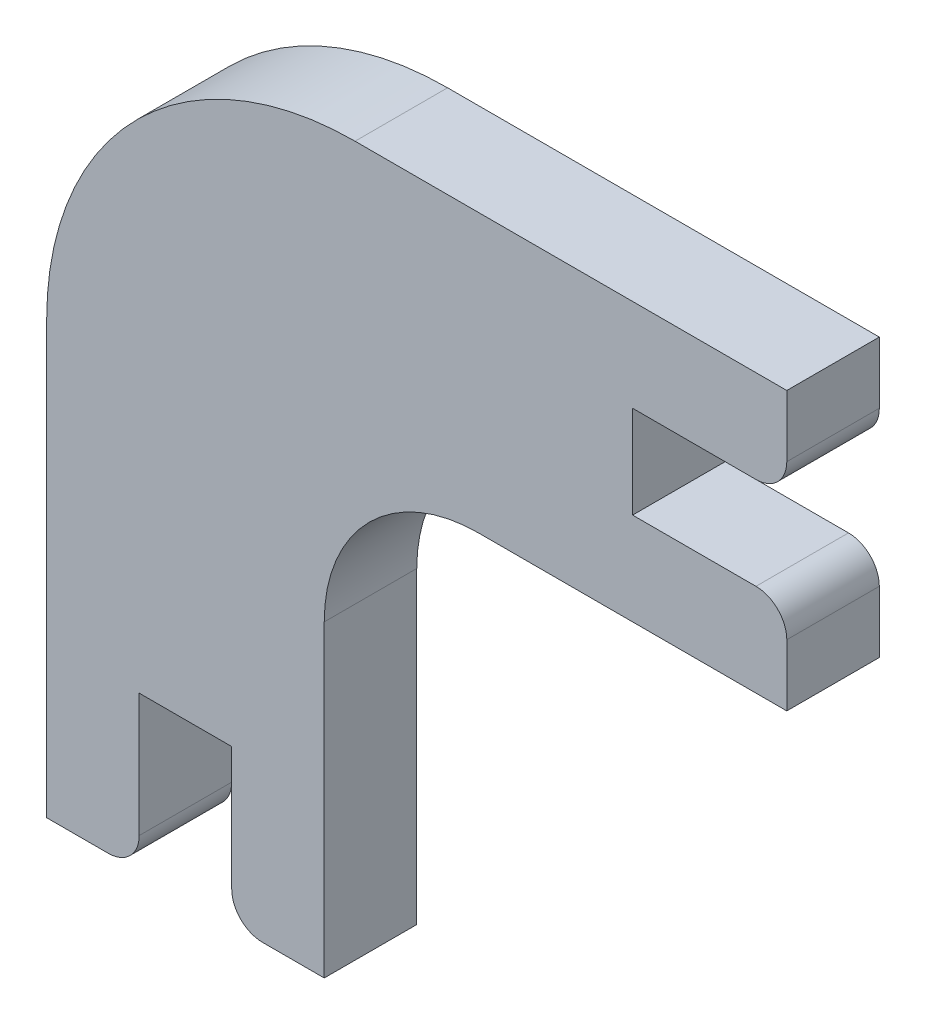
ISO-10303-21;
HEADER;
FILE_DESCRIPTION(('STEP AP214'),'2;1');
FILE_NAME('part.step','',(''),(''),'','','');
FILE_SCHEMA(('AUTOMOTIVE_DESIGN { 1 0 10303 214 1 1 1 1 }'));
ENDSEC;
DATA;
#1=APPLICATION_CONTEXT('core data for automotive mechanical design processes');
#2=APPLICATION_PROTOCOL_DEFINITION('international standard','automotive_design',2000,#1);
#3=PRODUCT_CONTEXT('',#1,'mechanical');
#4=PRODUCT('Part','Part','',(#3));
#5=PRODUCT_RELATED_PRODUCT_CATEGORY('part','',(#4));
#6=PRODUCT_DEFINITION_FORMATION('','',#4);
#7=PRODUCT_DEFINITION_CONTEXT('part definition',#1,'design');
#8=PRODUCT_DEFINITION('design','',#6,#7);
#9=PRODUCT_DEFINITION_SHAPE('','',#8);
#10=(LENGTH_UNIT() NAMED_UNIT(*) SI_UNIT(.MILLI.,.METRE.));
#11=(NAMED_UNIT(*) PLANE_ANGLE_UNIT() SI_UNIT($,.RADIAN.));
#12=(NAMED_UNIT(*) SI_UNIT($,.STERADIAN.) SOLID_ANGLE_UNIT());
#13=UNCERTAINTY_MEASURE_WITH_UNIT(LENGTH_MEASURE(1.E-05),#10,'distance_accuracy_value','');
#14=(GEOMETRIC_REPRESENTATION_CONTEXT(3) GLOBAL_UNCERTAINTY_ASSIGNED_CONTEXT((#13)) GLOBAL_UNIT_ASSIGNED_CONTEXT((#10,
#11,#12)) REPRESENTATION_CONTEXT('',''));
#15=CARTESIAN_POINT('',(0.,0.,0.));
#16=DIRECTION('',(0.,0.,1.));
#17=DIRECTION('',(1.,0.,0.));
#18=AXIS2_PLACEMENT_3D('',#15,#16,#17);
#19=CARTESIAN_POINT('',(0.,12.,3.));
#20=DIRECTION('',(-1.,0.,0.));
#21=DIRECTION('',(0.,0.,1.));
#22=AXIS2_PLACEMENT_3D('',#19,#20,#21);
#23=PLANE('',#22);
#24=DIRECTION('',(0.,1.,0.));
#25=VECTOR('',#24,1.);
#26=CARTESIAN_POINT('',(0.,12.,3.));
#27=LINE('',#26,#25);
#28=CARTESIAN_POINT('',(0.,14.,3.));
#29=VERTEX_POINT('',#28);
#30=CARTESIAN_POINT('',(0.,18.,3.));
#31=VERTEX_POINT('',#30);
#32=EDGE_CURVE('E167',#29,#31,#27,.T.);
#33=ORIENTED_EDGE('',*,*,#32,.F.);
#34=DIRECTION('',(0.,0.,-1.));
#35=VECTOR('',#34,1.);
#36=CARTESIAN_POINT('',(0.,14.,-3.));
#37=LINE('',#36,#35);
#38=CARTESIAN_POINT('',(0.,14.,-3.));
#39=VERTEX_POINT('',#38);
#40=EDGE_CURVE('E41',#29,#39,#37,.T.);
#41=ORIENTED_EDGE('',*,*,#40,.T.);
#42=DIRECTION('',(0.,1.,0.));
#43=VECTOR('',#42,1.);
#44=CARTESIAN_POINT('',(0.,12.,-3.));
#45=LINE('',#44,#43);
#46=CARTESIAN_POINT('',(0.,18.,-3.));
#47=VERTEX_POINT('',#46);
#48=EDGE_CURVE('E189',#39,#47,#45,.T.);
#49=ORIENTED_EDGE('',*,*,#48,.T.);
#50=DIRECTION('',(0.,0.,-1.));
#51=VECTOR('',#50,1.);
#52=CARTESIAN_POINT('',(0.,18.,3.));
#53=LINE('',#52,#51);
#54=EDGE_CURVE('E183',#31,#47,#53,.T.);
#55=ORIENTED_EDGE('',*,*,#54,.F.);
#56=EDGE_LOOP('',(#33,#41,#49,#55));
#57=FACE_BOUND('',#56,.T.);
#58=ADVANCED_FACE('F33',(#57),#23,.F.);
#59=CARTESIAN_POINT('',(0.,18.,3.));
#60=DIRECTION('',(0.,-1.,0.));
#61=DIRECTION('',(0.,0.,-1.));
#62=AXIS2_PLACEMENT_3D('',#59,#60,#61);
#63=PLANE('',#62);
#64=DIRECTION('',(-1.,0.,0.));
#65=VECTOR('',#64,1.);
#66=CARTESIAN_POINT('',(0.,18.,-3.));
#67=LINE('',#66,#65);
#68=CARTESIAN_POINT('',(-28.,18.,-3.));
#69=VERTEX_POINT('',#68);
#70=EDGE_CURVE('E248',#47,#69,#67,.T.);
#71=ORIENTED_EDGE('',*,*,#70,.T.);
#72=DIRECTION('',(0.,0.,-1.));
#73=VECTOR('',#72,1.);
#74=CARTESIAN_POINT('',(-28.,18.,3.));
#75=LINE('',#74,#73);
#76=CARTESIAN_POINT('',(-28.,18.,3.));
#77=VERTEX_POINT('',#76);
#78=EDGE_CURVE('E185',#69,#77,#75,.F.);
#79=ORIENTED_EDGE('',*,*,#78,.T.);
#80=DIRECTION('',(-1.,0.,0.));
#81=VECTOR('',#80,1.);
#82=CARTESIAN_POINT('',(0.,18.,3.));
#83=LINE('',#82,#81);
#84=EDGE_CURVE('E171',#31,#77,#83,.T.);
#85=ORIENTED_EDGE('',*,*,#84,.F.);
#86=ORIENTED_EDGE('',*,*,#54,.T.);
#87=EDGE_LOOP('',(#71,#79,#85,#86));
#88=FACE_BOUND('',#87,.T.);
#89=ADVANCED_FACE('F182',(#88),#63,.F.);
#90=CARTESIAN_POINT('',(-48.,18.,3.));
#91=DIRECTION('',(1.,0.,0.));
#92=DIRECTION('',(0.,0.,-1.));
#93=AXIS2_PLACEMENT_3D('',#90,#91,#92);
#94=PLANE('',#93);
#95=DIRECTION('',(0.,-1.,0.));
#96=VECTOR('',#95,1.);
#97=CARTESIAN_POINT('',(-48.,18.,3.));
#98=LINE('',#97,#96);
#99=CARTESIAN_POINT('',(-48.,-2.00000000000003,3.));
#100=VERTEX_POINT('',#99);
#101=CARTESIAN_POINT('',(-48.,-30.,3.));
#102=VERTEX_POINT('',#101);
#103=EDGE_CURVE('E186',#100,#102,#98,.T.);
#104=ORIENTED_EDGE('',*,*,#103,.F.);
#105=DIRECTION('',(0.,0.,-1.));
#106=VECTOR('',#105,1.);
#107=CARTESIAN_POINT('',(-48.,-2.00000000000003,3.));
#108=LINE('',#107,#106);
#109=CARTESIAN_POINT('',(-48.,-2.00000000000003,-3.));
#110=VERTEX_POINT('',#109);
#111=EDGE_CURVE('E191',#100,#110,#108,.T.);
#112=ORIENTED_EDGE('',*,*,#111,.T.);
#113=DIRECTION('',(0.,-1.,0.));
#114=VECTOR('',#113,1.);
#115=CARTESIAN_POINT('',(-48.,18.,-3.));
#116=LINE('',#115,#114);
#117=CARTESIAN_POINT('',(-48.,-30.,-3.));
#118=VERTEX_POINT('',#117);
#119=EDGE_CURVE('E250',#110,#118,#116,.T.);
#120=ORIENTED_EDGE('',*,*,#119,.T.);
#121=DIRECTION('',(0.,0.,-1.));
#122=VECTOR('',#121,1.);
#123=CARTESIAN_POINT('',(-48.,-30.,3.));
#124=LINE('',#123,#122);
#125=EDGE_CURVE('E192',#102,#118,#124,.T.);
#126=ORIENTED_EDGE('',*,*,#125,.F.);
#127=EDGE_LOOP('',(#104,#112,#120,#126));
#128=FACE_BOUND('',#127,.T.);
#129=ADVANCED_FACE('F350',(#128),#94,.F.);
#130=CARTESIAN_POINT('',(-42.,-30.,3.));
#131=DIRECTION('',(0.,-1.,0.));
#132=DIRECTION('',(0.,0.,-1.));
#133=AXIS2_PLACEMENT_3D('',#130,#131,#132);
#134=PLANE('',#133);
#135=DIRECTION('',(-1.,0.,0.));
#136=VECTOR('',#135,1.);
#137=CARTESIAN_POINT('',(-42.,-30.,-3.));
#138=LINE('',#137,#136);
#139=CARTESIAN_POINT('',(-44.,-30.,-3.));
#140=VERTEX_POINT('',#139);
#141=EDGE_CURVE('E258',#140,#118,#138,.T.);
#142=ORIENTED_EDGE('',*,*,#141,.F.);
#143=DIRECTION('',(0.,0.,-1.));
#144=VECTOR('',#143,1.);
#145=CARTESIAN_POINT('',(-44.,-30.,3.));
#146=LINE('',#145,#144);
#147=CARTESIAN_POINT('',(-44.,-30.,3.));
#148=VERTEX_POINT('',#147);
#149=EDGE_CURVE('E238',#140,#148,#146,.F.);
#150=ORIENTED_EDGE('',*,*,#149,.T.);
#151=DIRECTION('',(-1.,0.,0.));
#152=VECTOR('',#151,1.);
#153=CARTESIAN_POINT('',(-42.,-30.,3.));
#154=LINE('',#153,#152);
#155=EDGE_CURVE('E318',#148,#102,#154,.T.);
#156=ORIENTED_EDGE('',*,*,#155,.T.);
#157=ORIENTED_EDGE('',*,*,#125,.T.);
#158=EDGE_LOOP('',(#142,#150,#156,#157));
#159=FACE_BOUND('',#158,.T.);
#160=ADVANCED_FACE('F377',(#159),#134,.T.);
#161=CARTESIAN_POINT('',(-42.,-30.,3.));
#162=DIRECTION('',(-1.,0.,0.));
#163=DIRECTION('',(0.,0.,1.));
#164=AXIS2_PLACEMENT_3D('',#161,#162,#163);
#165=PLANE('',#164);
#166=DIRECTION('',(0.,1.,0.));
#167=VECTOR('',#166,1.);
#168=CARTESIAN_POINT('',(-42.,-30.,3.));
#169=LINE('',#168,#167);
#170=CARTESIAN_POINT('',(-42.,-28.,3.));
#171=VERTEX_POINT('',#170);
#172=CARTESIAN_POINT('',(-42.,-20.,3.));
#173=VERTEX_POINT('',#172);
#174=EDGE_CURVE('E316',#171,#173,#169,.T.);
#175=ORIENTED_EDGE('',*,*,#174,.F.);
#176=DIRECTION('',(0.,0.,-1.));
#177=VECTOR('',#176,1.);
#178=CARTESIAN_POINT('',(-42.,-28.,-3.));
#179=LINE('',#178,#177);
#180=CARTESIAN_POINT('',(-42.,-28.,-3.));
#181=VERTEX_POINT('',#180);
#182=EDGE_CURVE('E235',#171,#181,#179,.T.);
#183=ORIENTED_EDGE('',*,*,#182,.T.);
#184=DIRECTION('',(0.,1.,0.));
#185=VECTOR('',#184,1.);
#186=CARTESIAN_POINT('',(-42.,-30.,-3.));
#187=LINE('',#186,#185);
#188=CARTESIAN_POINT('',(-42.,-20.,-3.));
#189=VERTEX_POINT('',#188);
#190=EDGE_CURVE('E260',#181,#189,#187,.T.);
#191=ORIENTED_EDGE('',*,*,#190,.T.);
#192=DIRECTION('',(0.,0.,-1.));
#193=VECTOR('',#192,1.);
#194=CARTESIAN_POINT('',(-42.,-20.,3.));
#195=LINE('',#194,#193);
#196=EDGE_CURVE('E198',#173,#189,#195,.T.);
#197=ORIENTED_EDGE('',*,*,#196,.F.);
#198=EDGE_LOOP('',(#175,#183,#191,#197));
#199=FACE_BOUND('',#198,.T.);
#200=ADVANCED_FACE('F375',(#199),#165,.F.);
#201=CARTESIAN_POINT('',(-42.,-20.,3.));
#202=DIRECTION('',(0.,1.,0.));
#203=DIRECTION('',(0.,0.,1.));
#204=AXIS2_PLACEMENT_3D('',#201,#202,#203);
#205=PLANE('',#204);
#206=DIRECTION('',(1.,0.,0.));
#207=VECTOR('',#206,1.);
#208=CARTESIAN_POINT('',(-42.,-20.,-3.));
#209=LINE('',#208,#207);
#210=CARTESIAN_POINT('',(-36.,-20.,-3.));
#211=VERTEX_POINT('',#210);
#212=EDGE_CURVE('E262',#189,#211,#209,.T.);
#213=ORIENTED_EDGE('',*,*,#212,.T.);
#214=DIRECTION('',(0.,0.,-1.));
#215=VECTOR('',#214,1.);
#216=CARTESIAN_POINT('',(-36.,-20.,3.));
#217=LINE('',#216,#215);
#218=CARTESIAN_POINT('',(-36.,-20.,3.));
#219=VERTEX_POINT('',#218);
#220=EDGE_CURVE('E294',#219,#211,#217,.T.);
#221=ORIENTED_EDGE('',*,*,#220,.F.);
#222=DIRECTION('',(1.,0.,0.));
#223=VECTOR('',#222,1.);
#224=CARTESIAN_POINT('',(-42.,-20.,3.));
#225=LINE('',#224,#223);
#226=EDGE_CURVE('E304',#173,#219,#225,.T.);
#227=ORIENTED_EDGE('',*,*,#226,.F.);
#228=ORIENTED_EDGE('',*,*,#196,.T.);
#229=EDGE_LOOP('',(#213,#221,#227,#228));
#230=FACE_BOUND('',#229,.T.);
#231=ADVANCED_FACE('F301',(#230),#205,.F.);
#232=CARTESIAN_POINT('',(-36.,-30.,3.));
#233=DIRECTION('',(-1.,0.,0.));
#234=DIRECTION('',(0.,-1.,0.));
#235=AXIS2_PLACEMENT_3D('',#232,#233,#234);
#236=PLANE('',#235);
#237=DIRECTION('',(0.,1.,0.));
#238=VECTOR('',#237,1.);
#239=CARTESIAN_POINT('',(-36.,-30.,-3.));
#240=LINE('',#239,#238);
#241=CARTESIAN_POINT('',(-36.,-28.,-3.));
#242=VERTEX_POINT('',#241);
#243=EDGE_CURVE('E265',#242,#211,#240,.T.);
#244=ORIENTED_EDGE('',*,*,#243,.F.);
#245=DIRECTION('',(0.,0.,-1.));
#246=VECTOR('',#245,1.);
#247=CARTESIAN_POINT('',(-36.,-28.,3.));
#248=LINE('',#247,#246);
#249=CARTESIAN_POINT('',(-36.,-28.,3.));
#250=VERTEX_POINT('',#249);
#251=EDGE_CURVE('E226',#242,#250,#248,.F.);
#252=ORIENTED_EDGE('',*,*,#251,.T.);
#253=DIRECTION('',(0.,1.,0.));
#254=VECTOR('',#253,1.);
#255=CARTESIAN_POINT('',(-36.,-30.,3.));
#256=LINE('',#255,#254);
#257=EDGE_CURVE('E312',#250,#219,#256,.T.);
#258=ORIENTED_EDGE('',*,*,#257,.T.);
#259=ORIENTED_EDGE('',*,*,#220,.T.);
#260=EDGE_LOOP('',(#244,#252,#258,#259));
#261=FACE_BOUND('',#260,.T.);
#262=ADVANCED_FACE('F311',(#261),#236,.T.);
#263=CARTESIAN_POINT('',(-30.,-30.,3.));
#264=DIRECTION('',(0.,-1.,0.));
#265=DIRECTION('',(0.,0.,-1.));
#266=AXIS2_PLACEMENT_3D('',#263,#264,#265);
#267=PLANE('',#266);
#268=DIRECTION('',(-1.,0.,0.));
#269=VECTOR('',#268,1.);
#270=CARTESIAN_POINT('',(-30.,-30.,3.));
#271=LINE('',#270,#269);
#272=CARTESIAN_POINT('',(-30.,-30.,3.));
#273=VERTEX_POINT('',#272);
#274=CARTESIAN_POINT('',(-34.,-30.,3.));
#275=VERTEX_POINT('',#274);
#276=EDGE_CURVE('E314',#273,#275,#271,.T.);
#277=ORIENTED_EDGE('',*,*,#276,.T.);
#278=DIRECTION('',(0.,0.,-1.));
#279=VECTOR('',#278,1.);
#280=CARTESIAN_POINT('',(-34.,-30.,3.));
#281=LINE('',#280,#279);
#282=CARTESIAN_POINT('',(-34.,-30.,-3.));
#283=VERTEX_POINT('',#282);
#284=EDGE_CURVE('E215',#275,#283,#281,.T.);
#285=ORIENTED_EDGE('',*,*,#284,.T.);
#286=DIRECTION('',(-1.,0.,0.));
#287=VECTOR('',#286,1.);
#288=CARTESIAN_POINT('',(-30.,-30.,-3.));
#289=LINE('',#288,#287);
#290=CARTESIAN_POINT('',(-30.,-30.,-3.));
#291=VERTEX_POINT('',#290);
#292=EDGE_CURVE('E267',#291,#283,#289,.T.);
#293=ORIENTED_EDGE('',*,*,#292,.F.);
#294=DIRECTION('',(0.,0.,-1.));
#295=VECTOR('',#294,1.);
#296=CARTESIAN_POINT('',(-30.,-30.,3.));
#297=LINE('',#296,#295);
#298=EDGE_CURVE('E291',#273,#291,#297,.T.);
#299=ORIENTED_EDGE('',*,*,#298,.F.);
#300=EDGE_LOOP('',(#277,#285,#293,#299));
#301=FACE_BOUND('',#300,.T.);
#302=ADVANCED_FACE('F421',(#301),#267,.T.);
#303=CARTESIAN_POINT('',(-30.,0.,3.));
#304=DIRECTION('',(1.,0.,0.));
#305=DIRECTION('',(0.,1.,0.));
#306=AXIS2_PLACEMENT_3D('',#303,#304,#305);
#307=PLANE('',#306);
#308=DIRECTION('',(0.,-1.,0.));
#309=VECTOR('',#308,1.);
#310=CARTESIAN_POINT('',(-30.,0.,-3.));
#311=LINE('',#310,#309);
#312=CARTESIAN_POINT('',(-30.,-10.,-3.));
#313=VERTEX_POINT('',#312);
#314=EDGE_CURVE('E269',#313,#291,#311,.T.);
#315=ORIENTED_EDGE('',*,*,#314,.F.);
#316=DIRECTION('',(0.,0.,-1.));
#317=VECTOR('',#316,1.);
#318=CARTESIAN_POINT('',(-30.,-10.,3.));
#319=LINE('',#318,#317);
#320=CARTESIAN_POINT('',(-30.,-10.,3.));
#321=VERTEX_POINT('',#320);
#322=EDGE_CURVE('E209',#313,#321,#319,.F.);
#323=ORIENTED_EDGE('',*,*,#322,.T.);
#324=DIRECTION('',(0.,-1.,0.));
#325=VECTOR('',#324,1.);
#326=CARTESIAN_POINT('',(-30.,0.,3.));
#327=LINE('',#326,#325);
#328=EDGE_CURVE('E324',#321,#273,#327,.T.);
#329=ORIENTED_EDGE('',*,*,#328,.T.);
#330=ORIENTED_EDGE('',*,*,#298,.T.);
#331=EDGE_LOOP('',(#315,#323,#329,#330));
#332=FACE_BOUND('',#331,.T.);
#333=ADVANCED_FACE('F429',(#332),#307,.T.);
#334=CARTESIAN_POINT('',(0.,0.,3.));
#335=DIRECTION('',(0.,-1.,0.));
#336=DIRECTION('',(0.,0.,-1.));
#337=AXIS2_PLACEMENT_3D('',#334,#335,#336);
#338=PLANE('',#337);
#339=DIRECTION('',(-1.,0.,0.));
#340=VECTOR('',#339,1.);
#341=CARTESIAN_POINT('',(0.,0.,3.));
#342=LINE('',#341,#340);
#343=CARTESIAN_POINT('',(0.,0.,3.));
#344=VERTEX_POINT('',#343);
#345=CARTESIAN_POINT('',(-20.,0.,3.));
#346=VERTEX_POINT('',#345);
#347=EDGE_CURVE('E326',#344,#346,#342,.T.);
#348=ORIENTED_EDGE('',*,*,#347,.T.);
#349=DIRECTION('',(0.,0.,-1.));
#350=VECTOR('',#349,1.);
#351=CARTESIAN_POINT('',(-20.,0.,-3.));
#352=LINE('',#351,#350);
#353=CARTESIAN_POINT('',(-20.,0.,-3.));
#354=VERTEX_POINT('',#353);
#355=EDGE_CURVE('E206',#346,#354,#352,.T.);
#356=ORIENTED_EDGE('',*,*,#355,.T.);
#357=DIRECTION('',(-1.,0.,0.));
#358=VECTOR('',#357,1.);
#359=CARTESIAN_POINT('',(0.,0.,-3.));
#360=LINE('',#359,#358);
#361=CARTESIAN_POINT('',(0.,0.,-3.));
#362=VERTEX_POINT('',#361);
#363=EDGE_CURVE('E271',#362,#354,#360,.T.);
#364=ORIENTED_EDGE('',*,*,#363,.F.);
#365=DIRECTION('',(0.,0.,-1.));
#366=VECTOR('',#365,1.);
#367=CARTESIAN_POINT('',(0.,0.,3.));
#368=LINE('',#367,#366);
#369=EDGE_CURVE('E289',#344,#362,#368,.T.);
#370=ORIENTED_EDGE('',*,*,#369,.F.);
#371=EDGE_LOOP('',(#348,#356,#364,#370));
#372=FACE_BOUND('',#371,.T.);
#373=ADVANCED_FACE('F443',(#372),#338,.T.);
#374=CARTESIAN_POINT('',(0.,0.,3.));
#375=DIRECTION('',(-1.,0.,0.));
#376=DIRECTION('',(0.,0.,1.));
#377=AXIS2_PLACEMENT_3D('',#374,#375,#376);
#378=PLANE('',#377);
#379=DIRECTION('',(0.,1.,0.));
#380=VECTOR('',#379,1.);
#381=CARTESIAN_POINT('',(0.,0.,-3.));
#382=LINE('',#381,#380);
#383=CARTESIAN_POINT('',(0.,3.99999999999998,-3.));
#384=VERTEX_POINT('',#383);
#385=EDGE_CURVE('E274',#362,#384,#382,.T.);
#386=ORIENTED_EDGE('',*,*,#385,.T.);
#387=DIRECTION('',(0.,0.,-1.));
#388=VECTOR('',#387,1.);
#389=CARTESIAN_POINT('',(0.,3.99999999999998,3.));
#390=LINE('',#389,#388);
#391=CARTESIAN_POINT('',(0.,3.99999999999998,3.));
#392=VERTEX_POINT('',#391);
#393=EDGE_CURVE('E243',#384,#392,#390,.F.);
#394=ORIENTED_EDGE('',*,*,#393,.T.);
#395=DIRECTION('',(0.,1.,0.));
#396=VECTOR('',#395,1.);
#397=CARTESIAN_POINT('',(0.,0.,3.));
#398=LINE('',#397,#396);
#399=EDGE_CURVE('E329',#344,#392,#398,.T.);
#400=ORIENTED_EDGE('',*,*,#399,.F.);
#401=ORIENTED_EDGE('',*,*,#369,.T.);
#402=EDGE_LOOP('',(#386,#394,#400,#401));
#403=FACE_BOUND('',#402,.T.);
#404=ADVANCED_FACE('F437',(#403),#378,.F.);
#405=CARTESIAN_POINT('',(0.,5.99999999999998,3.));
#406=DIRECTION('',(0.,-1.,0.));
#407=DIRECTION('',(1.,0.,0.));
#408=AXIS2_PLACEMENT_3D('',#405,#406,#407);
#409=PLANE('',#408);
#410=DIRECTION('',(-1.,0.,0.));
#411=VECTOR('',#410,1.);
#412=CARTESIAN_POINT('',(0.,5.99999999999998,3.));
#413=LINE('',#412,#411);
#414=CARTESIAN_POINT('',(-2.,5.99999999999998,3.));
#415=VERTEX_POINT('',#414);
#416=CARTESIAN_POINT('',(-10.,5.99999999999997,3.));
#417=VERTEX_POINT('',#416);
#418=EDGE_CURVE('E332',#415,#417,#413,.T.);
#419=ORIENTED_EDGE('',*,*,#418,.F.);
#420=DIRECTION('',(0.,0.,-1.));
#421=VECTOR('',#420,1.);
#422=CARTESIAN_POINT('',(-2.,5.99999999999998,3.));
#423=LINE('',#422,#421);
#424=CARTESIAN_POINT('',(-2.,5.99999999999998,-3.));
#425=VERTEX_POINT('',#424);
#426=EDGE_CURVE('E240',#415,#425,#423,.T.);
#427=ORIENTED_EDGE('',*,*,#426,.T.);
#428=DIRECTION('',(-1.,0.,0.));
#429=VECTOR('',#428,1.);
#430=CARTESIAN_POINT('',(0.,5.99999999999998,-3.));
#431=LINE('',#430,#429);
#432=CARTESIAN_POINT('',(-10.,5.99999999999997,-3.));
#433=VERTEX_POINT('',#432);
#434=EDGE_CURVE('E277',#425,#433,#431,.T.);
#435=ORIENTED_EDGE('',*,*,#434,.T.);
#436=DIRECTION('',(0.,0.,-1.));
#437=VECTOR('',#436,1.);
#438=CARTESIAN_POINT('',(-10.,5.99999999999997,3.));
#439=LINE('',#438,#437);
#440=EDGE_CURVE('E286',#417,#433,#439,.T.);
#441=ORIENTED_EDGE('',*,*,#440,.F.);
#442=EDGE_LOOP('',(#419,#427,#435,#441));
#443=FACE_BOUND('',#442,.T.);
#444=ADVANCED_FACE('F442',(#443),#409,.F.);
#445=CARTESIAN_POINT('',(-10.,5.99999999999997,3.));
#446=DIRECTION('',(-1.,0.,0.));
#447=DIRECTION('',(0.,0.,1.));
#448=AXIS2_PLACEMENT_3D('',#445,#446,#447);
#449=PLANE('',#448);
#450=DIRECTION('',(0.,1.,0.));
#451=VECTOR('',#450,1.);
#452=CARTESIAN_POINT('',(-10.,5.99999999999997,-3.));
#453=LINE('',#452,#451);
#454=CARTESIAN_POINT('',(-10.,12.,-3.));
#455=VERTEX_POINT('',#454);
#456=EDGE_CURVE('E279',#433,#455,#453,.T.);
#457=ORIENTED_EDGE('',*,*,#456,.T.);
#458=DIRECTION('',(0.,0.,-1.));
#459=VECTOR('',#458,1.);
#460=CARTESIAN_POINT('',(-10.,12.,3.));
#461=LINE('',#460,#459);
#462=CARTESIAN_POINT('',(-10.,12.,3.));
#463=VERTEX_POINT('',#462);
#464=EDGE_CURVE('E283',#463,#455,#461,.T.);
#465=ORIENTED_EDGE('',*,*,#464,.F.);
#466=DIRECTION('',(0.,1.,0.));
#467=VECTOR('',#466,1.);
#468=CARTESIAN_POINT('',(-10.,5.99999999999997,3.));
#469=LINE('',#468,#467);
#470=EDGE_CURVE('E333',#417,#463,#469,.T.);
#471=ORIENTED_EDGE('',*,*,#470,.F.);
#472=ORIENTED_EDGE('',*,*,#440,.T.);
#473=EDGE_LOOP('',(#457,#465,#471,#472));
#474=FACE_BOUND('',#473,.T.);
#475=ADVANCED_FACE('F455',(#474),#449,.F.);
#476=CARTESIAN_POINT('',(0.,12.,3.));
#477=DIRECTION('',(0.,-1.,0.));
#478=DIRECTION('',(0.,0.,-1.));
#479=AXIS2_PLACEMENT_3D('',#476,#477,#478);
#480=PLANE('',#479);
#481=DIRECTION('',(-1.,0.,0.));
#482=VECTOR('',#481,1.);
#483=CARTESIAN_POINT('',(0.,12.,-3.));
#484=LINE('',#483,#482);
#485=CARTESIAN_POINT('',(-2.,12.,-3.));
#486=VERTEX_POINT('',#485);
#487=EDGE_CURVE('E177',#486,#455,#484,.T.);
#488=ORIENTED_EDGE('',*,*,#487,.F.);
#489=DIRECTION('',(0.,0.,-1.));
#490=VECTOR('',#489,1.);
#491=CARTESIAN_POINT('',(-2.,12.,3.));
#492=LINE('',#491,#490);
#493=CARTESIAN_POINT('',(-2.,12.,3.));
#494=VERTEX_POINT('',#493);
#495=EDGE_CURVE('E11',#486,#494,#492,.F.);
#496=ORIENTED_EDGE('',*,*,#495,.T.);
#497=DIRECTION('',(-1.,0.,0.));
#498=VECTOR('',#497,1.);
#499=CARTESIAN_POINT('',(0.,12.,3.));
#500=LINE('',#499,#498);
#501=EDGE_CURVE('E253',#494,#463,#500,.T.);
#502=ORIENTED_EDGE('',*,*,#501,.T.);
#503=ORIENTED_EDGE('',*,*,#464,.T.);
#504=EDGE_LOOP('',(#488,#496,#502,#503));
#505=FACE_BOUND('',#504,.T.);
#506=ADVANCED_FACE('F337',(#505),#480,.T.);
#507=CARTESIAN_POINT('',(0.,0.,3.));
#508=DIRECTION('',(0.,0.,1.));
#509=DIRECTION('',(1.,0.,0.));
#510=AXIS2_PLACEMENT_3D('',#507,#508,#509);
#511=PLANE('',#510);
#512=ORIENTED_EDGE('',*,*,#257,.F.);
#513=CARTESIAN_POINT('',(-34.,-28.,3.));
#514=DIRECTION('',(0.,0.,1.));
#515=DIRECTION('',(1.,0.,0.));
#516=AXIS2_PLACEMENT_3D('',#513,#514,#515);
#517=CIRCLE('',#516,2.);
#518=EDGE_CURVE('E233',#250,#275,#517,.T.);
#519=ORIENTED_EDGE('',*,*,#518,.T.);
#520=ORIENTED_EDGE('',*,*,#276,.F.);
#521=ORIENTED_EDGE('',*,*,#328,.F.);
#522=CARTESIAN_POINT('',(-20.,-10.,3.));
#523=DIRECTION('',(0.,0.,1.));
#524=DIRECTION('',(1.,0.,0.));
#525=AXIS2_PLACEMENT_3D('',#522,#523,#524);
#526=CIRCLE('',#525,10.);
#527=EDGE_CURVE('E213',#321,#346,#526,.F.);
#528=ORIENTED_EDGE('',*,*,#527,.T.);
#529=ORIENTED_EDGE('',*,*,#347,.F.);
#530=ORIENTED_EDGE('',*,*,#399,.T.);
#531=CARTESIAN_POINT('',(-2.,3.99999999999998,3.));
#532=DIRECTION('',(0.,0.,1.));
#533=DIRECTION('',(1.,0.,0.));
#534=AXIS2_PLACEMENT_3D('',#531,#532,#533);
#535=CIRCLE('',#534,2.);
#536=EDGE_CURVE('E229',#392,#415,#535,.T.);
#537=ORIENTED_EDGE('',*,*,#536,.T.);
#538=ORIENTED_EDGE('',*,*,#418,.T.);
#539=ORIENTED_EDGE('',*,*,#470,.T.);
#540=ORIENTED_EDGE('',*,*,#501,.F.);
#541=CARTESIAN_POINT('',(-2.,14.,3.));
#542=DIRECTION('',(0.,0.,1.));
#543=DIRECTION('',(1.,0.,0.));
#544=AXIS2_PLACEMENT_3D('',#541,#542,#543);
#545=CIRCLE('',#544,2.);
#546=EDGE_CURVE('E48',#494,#29,#545,.T.);
#547=ORIENTED_EDGE('',*,*,#546,.T.);
#548=ORIENTED_EDGE('',*,*,#32,.T.);
#549=ORIENTED_EDGE('',*,*,#84,.T.);
#550=CARTESIAN_POINT('',(-28.,-2.00000000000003,3.));
#551=DIRECTION('',(0.,0.,1.));
#552=DIRECTION('',(1.,0.,0.));
#553=AXIS2_PLACEMENT_3D('',#550,#551,#552);
#554=CIRCLE('',#553,20.);
#555=EDGE_CURVE('E204',#77,#100,#554,.T.);
#556=ORIENTED_EDGE('',*,*,#555,.T.);
#557=ORIENTED_EDGE('',*,*,#103,.T.);
#558=ORIENTED_EDGE('',*,*,#155,.F.);
#559=CARTESIAN_POINT('',(-44.,-28.,3.));
#560=DIRECTION('',(0.,0.,1.));
#561=DIRECTION('',(1.,0.,0.));
#562=AXIS2_PLACEMENT_3D('',#559,#560,#561);
#563=CIRCLE('',#562,2.);
#564=EDGE_CURVE('E231',#148,#171,#563,.T.);
#565=ORIENTED_EDGE('',*,*,#564,.T.);
#566=ORIENTED_EDGE('',*,*,#174,.T.);
#567=ORIENTED_EDGE('',*,*,#226,.T.);
#568=EDGE_LOOP('',(#512,#519,#520,#521,#528,#529,#530,#537,#538,#539,#540,#547,#548,#549,#556,
#557,#558,#565,#566,#567));
#569=FACE_BOUND('',#568,.T.);
#570=ADVANCED_FACE('F170',(#569),#511,.T.);
#571=CARTESIAN_POINT('',(0.,0.,-3.));
#572=DIRECTION('',(0.,0.,1.));
#573=DIRECTION('',(1.,0.,0.));
#574=AXIS2_PLACEMENT_3D('',#571,#572,#573);
#575=PLANE('',#574);
#576=ORIENTED_EDGE('',*,*,#292,.T.);
#577=CARTESIAN_POINT('',(-34.,-28.,-3.));
#578=DIRECTION('',(0.,0.,1.));
#579=DIRECTION('',(1.,0.,0.));
#580=AXIS2_PLACEMENT_3D('',#577,#578,#579);
#581=CIRCLE('',#580,2.);
#582=EDGE_CURVE('E224',#283,#242,#581,.F.);
#583=ORIENTED_EDGE('',*,*,#582,.T.);
#584=ORIENTED_EDGE('',*,*,#243,.T.);
#585=ORIENTED_EDGE('',*,*,#212,.F.);
#586=ORIENTED_EDGE('',*,*,#190,.F.);
#587=CARTESIAN_POINT('',(-44.,-28.,-3.));
#588=DIRECTION('',(0.,0.,1.));
#589=DIRECTION('',(1.,0.,0.));
#590=AXIS2_PLACEMENT_3D('',#587,#588,#589);
#591=CIRCLE('',#590,2.);
#592=EDGE_CURVE('E222',#181,#140,#591,.F.);
#593=ORIENTED_EDGE('',*,*,#592,.T.);
#594=ORIENTED_EDGE('',*,*,#141,.T.);
#595=ORIENTED_EDGE('',*,*,#119,.F.);
#596=CARTESIAN_POINT('',(-28.,-2.00000000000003,-3.));
#597=DIRECTION('',(0.,0.,1.));
#598=DIRECTION('',(1.,0.,0.));
#599=AXIS2_PLACEMENT_3D('',#596,#597,#598);
#600=CIRCLE('',#599,20.);
#601=EDGE_CURVE('E195',#110,#69,#600,.F.);
#602=ORIENTED_EDGE('',*,*,#601,.T.);
#603=ORIENTED_EDGE('',*,*,#70,.F.);
#604=ORIENTED_EDGE('',*,*,#48,.F.);
#605=CARTESIAN_POINT('',(-2.,14.,-3.));
#606=DIRECTION('',(0.,0.,1.));
#607=DIRECTION('',(1.,0.,0.));
#608=AXIS2_PLACEMENT_3D('',#605,#606,#607);
#609=CIRCLE('',#608,2.);
#610=EDGE_CURVE('E218',#39,#486,#609,.F.);
#611=ORIENTED_EDGE('',*,*,#610,.T.);
#612=ORIENTED_EDGE('',*,*,#487,.T.);
#613=ORIENTED_EDGE('',*,*,#456,.F.);
#614=ORIENTED_EDGE('',*,*,#434,.F.);
#615=CARTESIAN_POINT('',(-2.,3.99999999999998,-3.));
#616=DIRECTION('',(0.,0.,1.));
#617=DIRECTION('',(1.,0.,0.));
#618=AXIS2_PLACEMENT_3D('',#615,#616,#617);
#619=CIRCLE('',#618,2.);
#620=EDGE_CURVE('E220',#425,#384,#619,.F.);
#621=ORIENTED_EDGE('',*,*,#620,.T.);
#622=ORIENTED_EDGE('',*,*,#385,.F.);
#623=ORIENTED_EDGE('',*,*,#363,.T.);
#624=CARTESIAN_POINT('',(-20.,-10.,-3.));
#625=DIRECTION('',(0.,0.,1.));
#626=DIRECTION('',(1.,0.,0.));
#627=AXIS2_PLACEMENT_3D('',#624,#625,#626);
#628=CIRCLE('',#627,10.);
#629=EDGE_CURVE('E211',#354,#313,#628,.T.);
#630=ORIENTED_EDGE('',*,*,#629,.T.);
#631=ORIENTED_EDGE('',*,*,#314,.T.);
#632=EDGE_LOOP('',(#576,#583,#584,#585,#586,#593,#594,#595,#602,#603,#604,#611,#612,#613,#614,
#621,#622,#623,#630,#631));
#633=FACE_BOUND('',#632,.T.);
#634=ADVANCED_FACE('F247',(#633),#575,.F.);
#635=CARTESIAN_POINT('',(-28.,-2.00000000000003,3.));
#636=DIRECTION('',(0.,0.,-1.));
#637=DIRECTION('',(-1.,0.,0.));
#638=AXIS2_PLACEMENT_3D('',#635,#636,#637);
#639=CYLINDRICAL_SURFACE('',#638,20.);
#640=ORIENTED_EDGE('',*,*,#555,.F.);
#641=ORIENTED_EDGE('',*,*,#78,.F.);
#642=ORIENTED_EDGE('',*,*,#601,.F.);
#643=ORIENTED_EDGE('',*,*,#111,.F.);
#644=EDGE_LOOP('',(#640,#641,#642,#643));
#645=FACE_BOUND('',#644,.T.);
#646=ADVANCED_FACE('F354',(#645),#639,.T.);
#647=CARTESIAN_POINT('',(-20.,-10.,3.));
#648=DIRECTION('',(0.,0.,1.));
#649=DIRECTION('',(1.,0.,0.));
#650=AXIS2_PLACEMENT_3D('',#647,#648,#649);
#651=CYLINDRICAL_SURFACE('',#650,10.);
#652=ORIENTED_EDGE('',*,*,#527,.F.);
#653=ORIENTED_EDGE('',*,*,#322,.F.);
#654=ORIENTED_EDGE('',*,*,#629,.F.);
#655=ORIENTED_EDGE('',*,*,#355,.F.);
#656=EDGE_LOOP('',(#652,#653,#654,#655));
#657=FACE_BOUND('',#656,.T.);
#658=ADVANCED_FACE('F357',(#657),#651,.F.);
#659=CARTESIAN_POINT('',(-34.,-28.,3.));
#660=DIRECTION('',(0.,0.,-1.));
#661=DIRECTION('',(-1.,0.,0.));
#662=AXIS2_PLACEMENT_3D('',#659,#660,#661);
#663=CYLINDRICAL_SURFACE('',#662,2.);
#664=ORIENTED_EDGE('',*,*,#518,.F.);
#665=ORIENTED_EDGE('',*,*,#251,.F.);
#666=ORIENTED_EDGE('',*,*,#582,.F.);
#667=ORIENTED_EDGE('',*,*,#284,.F.);
#668=EDGE_LOOP('',(#664,#665,#666,#667));
#669=FACE_BOUND('',#668,.T.);
#670=ADVANCED_FACE('F361',(#669),#663,.T.);
#671=CARTESIAN_POINT('',(-44.,-28.,3.));
#672=DIRECTION('',(0.,0.,1.));
#673=DIRECTION('',(1.,0.,0.));
#674=AXIS2_PLACEMENT_3D('',#671,#672,#673);
#675=CYLINDRICAL_SURFACE('',#674,2.);
#676=ORIENTED_EDGE('',*,*,#564,.F.);
#677=ORIENTED_EDGE('',*,*,#149,.F.);
#678=ORIENTED_EDGE('',*,*,#592,.F.);
#679=ORIENTED_EDGE('',*,*,#182,.F.);
#680=EDGE_LOOP('',(#676,#677,#678,#679));
#681=FACE_BOUND('',#680,.T.);
#682=ADVANCED_FACE('F343',(#681),#675,.T.);
#683=CARTESIAN_POINT('',(-2.,3.99999999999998,3.));
#684=DIRECTION('',(0.,0.,-1.));
#685=DIRECTION('',(-1.,0.,0.));
#686=AXIS2_PLACEMENT_3D('',#683,#684,#685);
#687=CYLINDRICAL_SURFACE('',#686,2.);
#688=ORIENTED_EDGE('',*,*,#536,.F.);
#689=ORIENTED_EDGE('',*,*,#393,.F.);
#690=ORIENTED_EDGE('',*,*,#620,.F.);
#691=ORIENTED_EDGE('',*,*,#426,.F.);
#692=EDGE_LOOP('',(#688,#689,#690,#691));
#693=FACE_BOUND('',#692,.T.);
#694=ADVANCED_FACE('F339',(#693),#687,.T.);
#695=CARTESIAN_POINT('',(-2.,14.,3.));
#696=DIRECTION('',(0.,0.,1.));
#697=DIRECTION('',(1.,0.,0.));
#698=AXIS2_PLACEMENT_3D('',#695,#696,#697);
#699=CYLINDRICAL_SURFACE('',#698,2.);
#700=ORIENTED_EDGE('',*,*,#546,.F.);
#701=ORIENTED_EDGE('',*,*,#495,.F.);
#702=ORIENTED_EDGE('',*,*,#610,.F.);
#703=ORIENTED_EDGE('',*,*,#40,.F.);
#704=EDGE_LOOP('',(#700,#701,#702,#703));
#705=FACE_BOUND('',#704,.T.);
#706=ADVANCED_FACE('F35',(#705),#699,.T.);
#707=CLOSED_SHELL('',(#58,#89,#129,#160,#200,#231,#262,#302,#333,#373,#404,#444,#475,#506,#570,
#634,#646,#658,#670,#682,#694,#706));
#708=MANIFOLD_SOLID_BREP('B2',#707);
#709=ADVANCED_BREP_SHAPE_REPRESENTATION('',(#18,#708),#14);
#710=SHAPE_DEFINITION_REPRESENTATION(#9,#709);
ENDSEC;
END-ISO-10303-21;
